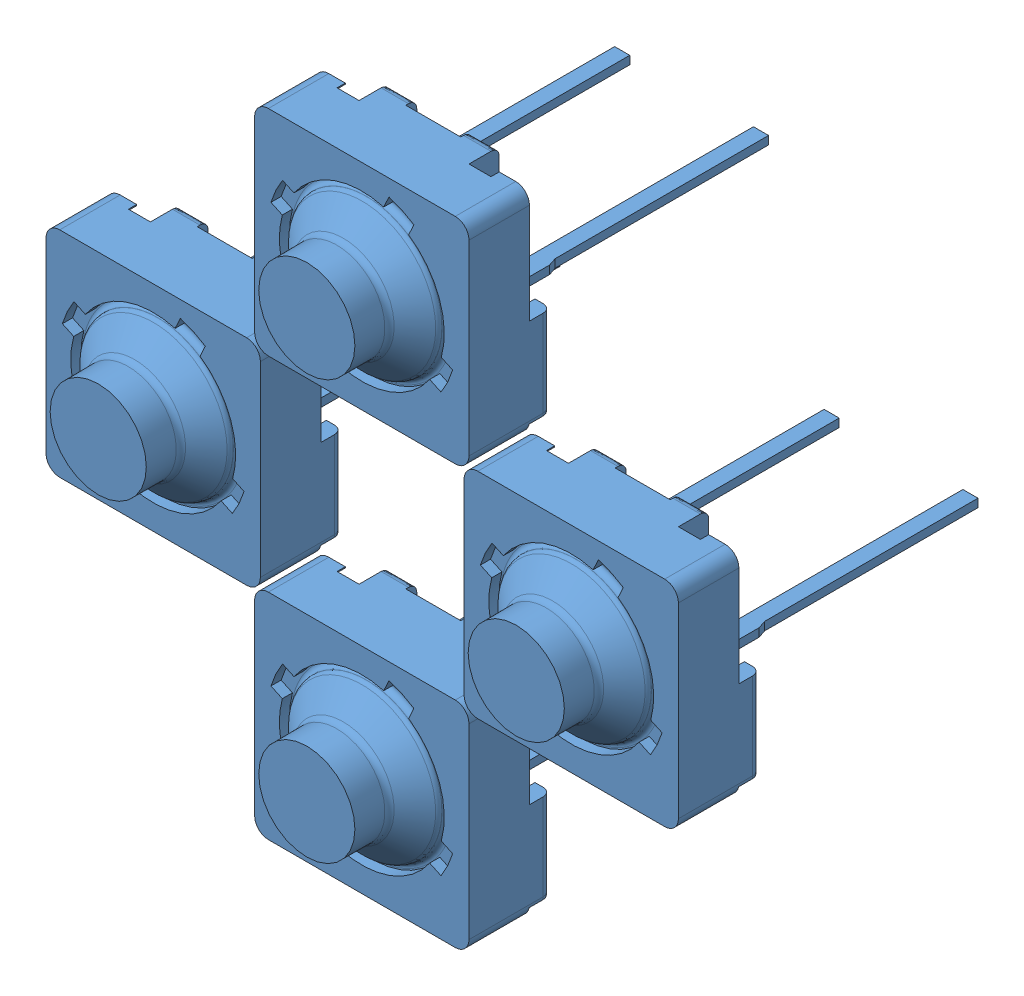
SolidWorks assembly D-Pad.SLDASM, configuration Default (file format 6000). Lengths in mm.
Overall size (23.03 23.24 14).
4 component instances, 1 part files, 9 mates.
Components (placement in the parent):
- SKPDAM-1: SKPDAM.SLDPRT [Default] at (-81.9261 13.7213 35.9788) size (7.82 8 14)
- SKPDAM-2: SKPDAM.SLDPRT [Default] at (-74.3361 21.3413 35.9788) size (7.82 8 14)
- SKPDAM-3: SKPDAM.SLDPRT [Default] at (-66.7161 13.7213 35.9788) size (7.82 8 14)
- SKPDAM-4: SKPDAM.SLDPRT [Default] at (-74.3361 6.1013 35.9788) size (7.82 8 14)
Mates (geometry in assembly coordinates):
- Coincident1: coincident aligned: plane of SKPDAM-1 through (-78.5261 17.1213 35.9788) normal (0 0 -1); plane of SKPDAM-2 through (-77.7361 24.7413 35.9788) normal (0 0 -1)
- Coincident2: coincident aligned: plane of SKPDAM-1 through (-78.5261 17.1213 35.9788) normal (0 0 -1); plane of SKPDAM-4 through (-77.7361 9.5013 35.9788) normal (0 0 -1)
- Coincident3: coincident aligned: plane of SKPDAM-1 through (-78.5261 17.1213 35.9788) normal (0 0 -1); plane of SKPDAM-3 through (-70.1161 17.1213 35.9788) normal (0 0 -1)
- Distance1: distance = 2.54 mm aligned: plane of SKPDAM-1 through (-79.6761 13.8713 35.743) normal (-1 0 0); plane of SKPDAM-4 through (-77.1361 6.2513 26.343) normal (-1 0 0)
- Distance2: distance = 7.62 mm aligned: plane of SKPDAM-1 through (-79.9261 13.8713 39.593) normal (0 1 0); plane of SKPDAM-4 through (-76.3361 6.2513 39.593) normal (0 1 0)
- Distance3: distance = 7.62 mm aligned: plane of SKPDAM-2 through (-76.3361 21.4913 39.593) normal (0 1 0); plane of SKPDAM-1 through (-79.9261 13.8713 39.593) normal (0 1 0)
- Coincident6: coincident aligned: plane of SKPDAM-2 through (-78.2361 21.3413 38.9788) normal (-1 0 0); plane of SKPDAM-4 through (-78.2361 6.1013 38.9788) normal (-1 0 0)
- Distance4: distance = 10.16 mm aligned: plane of SKPDAM-1 through (-79.6761 13.8713 35.743) normal (-1 0 0); plane of SKPDAM-3 through (-69.5161 13.8713 26.343) normal (-1 0 0)
- Coincident8: coincident aligned: plane of SKPDAM-1 through (-81.9261 17.6213 38.9788) normal (0 1 0); plane of SKPDAM-3 through (-66.7161 17.6213 38.9788) normal (0 1 0)
